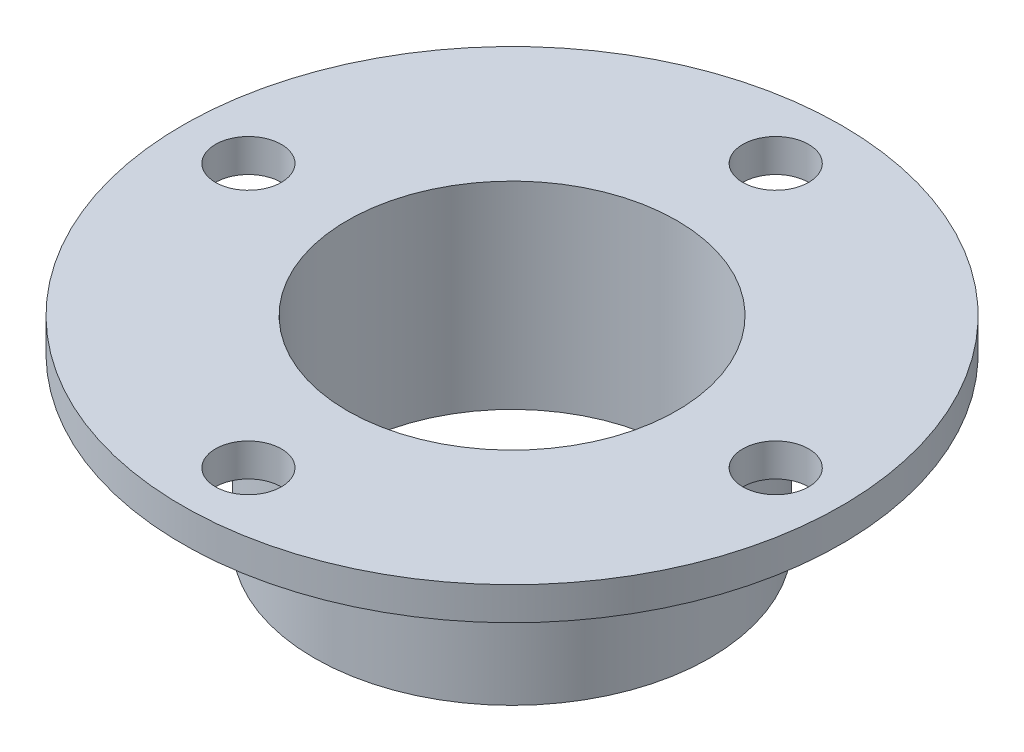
ISO-10303-21;
HEADER;
FILE_DESCRIPTION(('STEP AP214'),'2;1');
FILE_NAME('part.step','',(''),(''),'','','');
FILE_SCHEMA(('AUTOMOTIVE_DESIGN { 1 0 10303 214 1 1 1 1 }'));
ENDSEC;
DATA;
#1=APPLICATION_CONTEXT('core data for automotive mechanical design processes');
#2=APPLICATION_PROTOCOL_DEFINITION('international standard','automotive_design',2000,#1);
#3=PRODUCT_CONTEXT('',#1,'mechanical');
#4=PRODUCT('Part','Part','',(#3));
#5=PRODUCT_RELATED_PRODUCT_CATEGORY('part','',(#4));
#6=PRODUCT_DEFINITION_FORMATION('','',#4);
#7=PRODUCT_DEFINITION_CONTEXT('part definition',#1,'design');
#8=PRODUCT_DEFINITION('design','',#6,#7);
#9=PRODUCT_DEFINITION_SHAPE('','',#8);
#10=(LENGTH_UNIT() NAMED_UNIT(*) SI_UNIT(.MILLI.,.METRE.));
#11=(NAMED_UNIT(*) PLANE_ANGLE_UNIT() SI_UNIT($,.RADIAN.));
#12=(NAMED_UNIT(*) SI_UNIT($,.STERADIAN.) SOLID_ANGLE_UNIT());
#13=UNCERTAINTY_MEASURE_WITH_UNIT(LENGTH_MEASURE(1.E-05),#10,'distance_accuracy_value','');
#14=(GEOMETRIC_REPRESENTATION_CONTEXT(3) GLOBAL_UNCERTAINTY_ASSIGNED_CONTEXT((#13)) GLOBAL_UNIT_ASSIGNED_CONTEXT((#10,
#11,#12)) REPRESENTATION_CONTEXT('',''));
#15=CARTESIAN_POINT('',(0.,0.,0.));
#16=DIRECTION('',(0.,0.,1.));
#17=DIRECTION('',(1.,0.,0.));
#18=AXIS2_PLACEMENT_3D('',#15,#16,#17);
#19=CARTESIAN_POINT('',(38.1,0.,0.));
#20=DIRECTION('',(0.,-1.,0.));
#21=DIRECTION('',(0.,0.,-1.));
#22=AXIS2_PLACEMENT_3D('',#19,#20,#21);
#23=PLANE('',#22);
#24=CARTESIAN_POINT('',(0.,0.,0.));
#25=DIRECTION('',(0.,-1.,0.));
#26=DIRECTION('',(0.,0.,-1.));
#27=AXIS2_PLACEMENT_3D('',#24,#25,#26);
#28=CIRCLE('',#27,31.75);
#29=CARTESIAN_POINT('',(0.,0.,-31.75));
#30=VERTEX_POINT('',#29);
#31=EDGE_CURVE('E49',#30,#30,#28,.T.);
#32=ORIENTED_EDGE('',*,*,#31,.F.);
#33=EDGE_LOOP('',(#32));
#34=FACE_BOUND('',#33,.T.);
#35=CARTESIAN_POINT('',(0.,0.,0.));
#36=DIRECTION('',(0.,-1.,0.));
#37=DIRECTION('',(0.,0.,-1.));
#38=AXIS2_PLACEMENT_3D('',#35,#36,#37);
#39=CIRCLE('',#38,38.1);
#40=CARTESIAN_POINT('',(0.,0.,-38.1));
#41=VERTEX_POINT('',#40);
#42=EDGE_CURVE('E74',#41,#41,#39,.T.);
#43=ORIENTED_EDGE('',*,*,#42,.T.);
#44=EDGE_LOOP('',(#43));
#45=FACE_BOUND('',#44,.T.);
#46=ADVANCED_FACE('F30',(#34,#45),#23,.T.);
#47=CARTESIAN_POINT('',(0.,38.1,0.));
#48=DIRECTION('',(0.,1.,0.));
#49=DIRECTION('',(0.,0.,1.));
#50=AXIS2_PLACEMENT_3D('',#47,#48,#49);
#51=PLANE('',#50);
#52=CARTESIAN_POINT('',(-50.8,38.1,-5.3210206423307E-13));
#53=DIRECTION('',(0.,1.,0.));
#54=DIRECTION('',(1.,0.,0.));
#55=AXIS2_PLACEMENT_3D('',#52,#53,#54);
#56=CIRCLE('',#55,6.35);
#57=CARTESIAN_POINT('',(-50.8,38.1,6.34999999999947));
#58=VERTEX_POINT('',#57);
#59=EDGE_CURVE('E66',#58,#58,#56,.T.);
#60=ORIENTED_EDGE('',*,*,#59,.F.);
#61=EDGE_LOOP('',(#60));
#62=FACE_BOUND('',#61,.T.);
#63=CARTESIAN_POINT('',(0.,38.1,50.8));
#64=DIRECTION('',(0.,1.,0.));
#65=DIRECTION('',(0.,0.,-1.));
#66=AXIS2_PLACEMENT_3D('',#63,#64,#65);
#67=CIRCLE('',#66,6.35);
#68=CARTESIAN_POINT('',(0.,38.1,57.15));
#69=VERTEX_POINT('',#68);
#70=EDGE_CURVE('E56',#69,#69,#67,.T.);
#71=ORIENTED_EDGE('',*,*,#70,.F.);
#72=EDGE_LOOP('',(#71));
#73=FACE_BOUND('',#72,.T.);
#74=CARTESIAN_POINT('',(50.8,38.1,1.77367354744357E-13));
#75=DIRECTION('',(0.,1.,0.));
#76=DIRECTION('',(-1.,0.,0.));
#77=AXIS2_PLACEMENT_3D('',#74,#75,#76);
#78=CIRCLE('',#77,6.35);
#79=CARTESIAN_POINT('',(50.8,38.1,6.35000000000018));
#80=VERTEX_POINT('',#79);
#81=EDGE_CURVE('E53',#80,#80,#78,.T.);
#82=ORIENTED_EDGE('',*,*,#81,.F.);
#83=EDGE_LOOP('',(#82));
#84=FACE_BOUND('',#83,.T.);
#85=CARTESIAN_POINT('',(0.,38.1,-50.8));
#86=DIRECTION('',(0.,1.,0.));
#87=DIRECTION('',(0.,0.,1.));
#88=AXIS2_PLACEMENT_3D('',#85,#86,#87);
#89=CIRCLE('',#88,6.35);
#90=CARTESIAN_POINT('',(0.,38.1,-44.45));
#91=VERTEX_POINT('',#90);
#92=EDGE_CURVE('E50',#91,#91,#89,.T.);
#93=ORIENTED_EDGE('',*,*,#92,.F.);
#94=EDGE_LOOP('',(#93));
#95=FACE_BOUND('',#94,.T.);
#96=CARTESIAN_POINT('',(0.,38.1,0.));
#97=DIRECTION('',(0.,-1.,0.));
#98=DIRECTION('',(0.,0.,-1.));
#99=AXIS2_PLACEMENT_3D('',#96,#97,#98);
#100=CIRCLE('',#99,31.75);
#101=CARTESIAN_POINT('',(0.,38.1,-31.75));
#102=VERTEX_POINT('',#101);
#103=EDGE_CURVE('E71',#102,#102,#100,.T.);
#104=ORIENTED_EDGE('',*,*,#103,.T.);
#105=EDGE_LOOP('',(#104));
#106=FACE_BOUND('',#105,.T.);
#107=CARTESIAN_POINT('',(0.,38.1,0.));
#108=DIRECTION('',(0.,-1.,0.));
#109=DIRECTION('',(0.,0.,-1.));
#110=AXIS2_PLACEMENT_3D('',#107,#108,#109);
#111=CIRCLE('',#110,63.5);
#112=CARTESIAN_POINT('',(0.,38.1,-63.5));
#113=VERTEX_POINT('',#112);
#114=EDGE_CURVE('E10',#113,#113,#111,.T.);
#115=ORIENTED_EDGE('',*,*,#114,.F.);
#116=EDGE_LOOP('',(#115));
#117=FACE_BOUND('',#116,.T.);
#118=ADVANCED_FACE('F95',(#62,#73,#84,#95,#106,#117),#51,.T.);
#119=CARTESIAN_POINT('',(0.,0.,0.));
#120=DIRECTION('',(0.,-1.,0.));
#121=DIRECTION('',(0.,0.,-1.));
#122=AXIS2_PLACEMENT_3D('',#119,#120,#121);
#123=CYLINDRICAL_SURFACE('',#122,63.5);
#124=ORIENTED_EDGE('',*,*,#114,.T.);
#125=EDGE_LOOP('',(#124));
#126=FACE_BOUND('',#125,.T.);
#127=CARTESIAN_POINT('',(0.,31.75,0.));
#128=DIRECTION('',(0.,-1.,0.));
#129=DIRECTION('',(0.,0.,-1.));
#130=AXIS2_PLACEMENT_3D('',#127,#128,#129);
#131=CIRCLE('',#130,63.5);
#132=CARTESIAN_POINT('',(0.,31.75,-63.5));
#133=VERTEX_POINT('',#132);
#134=EDGE_CURVE('E37',#133,#133,#131,.T.);
#135=ORIENTED_EDGE('',*,*,#134,.F.);
#136=EDGE_LOOP('',(#135));
#137=FACE_BOUND('',#136,.T.);
#138=ADVANCED_FACE('F86',(#126,#137),#123,.T.);
#139=CARTESIAN_POINT('',(63.5,31.75,0.));
#140=DIRECTION('',(0.,-1.,0.));
#141=DIRECTION('',(0.,0.,-1.));
#142=AXIS2_PLACEMENT_3D('',#139,#140,#141);
#143=PLANE('',#142);
#144=CARTESIAN_POINT('',(-50.8,31.75,-5.3210206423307E-13));
#145=DIRECTION('',(0.,-1.,0.));
#146=DIRECTION('',(0.,0.,-1.));
#147=AXIS2_PLACEMENT_3D('',#144,#145,#146);
#148=CIRCLE('',#147,6.35);
#149=CARTESIAN_POINT('',(-50.8,31.75,6.34999999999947));
#150=VERTEX_POINT('',#149);
#151=EDGE_CURVE('E33',#150,#150,#148,.T.);
#152=ORIENTED_EDGE('',*,*,#151,.F.);
#153=EDGE_LOOP('',(#152));
#154=FACE_BOUND('',#153,.T.);
#155=CARTESIAN_POINT('',(0.,31.75,50.8));
#156=DIRECTION('',(0.,-1.,0.));
#157=DIRECTION('',(0.,0.,-1.));
#158=AXIS2_PLACEMENT_3D('',#155,#156,#157);
#159=CIRCLE('',#158,6.35);
#160=CARTESIAN_POINT('',(0.,31.75,57.15));
#161=VERTEX_POINT('',#160);
#162=EDGE_CURVE('E54',#161,#161,#159,.T.);
#163=ORIENTED_EDGE('',*,*,#162,.F.);
#164=EDGE_LOOP('',(#163));
#165=FACE_BOUND('',#164,.T.);
#166=CARTESIAN_POINT('',(50.8,31.75,1.77367354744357E-13));
#167=DIRECTION('',(0.,-1.,0.));
#168=DIRECTION('',(0.,0.,-1.));
#169=AXIS2_PLACEMENT_3D('',#166,#167,#168);
#170=CIRCLE('',#169,6.35);
#171=CARTESIAN_POINT('',(50.8,31.75,6.35000000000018));
#172=VERTEX_POINT('',#171);
#173=EDGE_CURVE('E51',#172,#172,#170,.T.);
#174=ORIENTED_EDGE('',*,*,#173,.F.);
#175=EDGE_LOOP('',(#174));
#176=FACE_BOUND('',#175,.T.);
#177=CARTESIAN_POINT('',(0.,31.75,-50.8));
#178=DIRECTION('',(0.,-1.,0.));
#179=DIRECTION('',(0.,0.,-1.));
#180=AXIS2_PLACEMENT_3D('',#177,#178,#179);
#181=CIRCLE('',#180,6.35);
#182=CARTESIAN_POINT('',(0.,31.75,-44.45));
#183=VERTEX_POINT('',#182);
#184=EDGE_CURVE('E46',#183,#183,#181,.T.);
#185=ORIENTED_EDGE('',*,*,#184,.F.);
#186=EDGE_LOOP('',(#185));
#187=FACE_BOUND('',#186,.T.);
#188=ORIENTED_EDGE('',*,*,#134,.T.);
#189=EDGE_LOOP('',(#188));
#190=FACE_BOUND('',#189,.T.);
#191=CARTESIAN_POINT('',(0.,31.75,0.));
#192=DIRECTION('',(0.,-1.,0.));
#193=DIRECTION('',(0.,0.,-1.));
#194=AXIS2_PLACEMENT_3D('',#191,#192,#193);
#195=CIRCLE('',#194,38.1);
#196=CARTESIAN_POINT('',(0.,31.75,-38.1));
#197=VERTEX_POINT('',#196);
#198=EDGE_CURVE('E42',#197,#197,#195,.T.);
#199=ORIENTED_EDGE('',*,*,#198,.F.);
#200=EDGE_LOOP('',(#199));
#201=FACE_BOUND('',#200,.T.);
#202=ADVANCED_FACE('F84',(#154,#165,#176,#187,#190,#201),#143,.T.);
#203=CARTESIAN_POINT('',(0.,0.,0.));
#204=DIRECTION('',(0.,-1.,0.));
#205=DIRECTION('',(0.,0.,-1.));
#206=AXIS2_PLACEMENT_3D('',#203,#204,#205);
#207=CYLINDRICAL_SURFACE('',#206,38.1);
#208=ORIENTED_EDGE('',*,*,#198,.T.);
#209=EDGE_LOOP('',(#208));
#210=FACE_BOUND('',#209,.T.);
#211=ORIENTED_EDGE('',*,*,#42,.F.);
#212=EDGE_LOOP('',(#211));
#213=FACE_BOUND('',#212,.T.);
#214=ADVANCED_FACE('F81',(#210,#213),#207,.T.);
#215=CARTESIAN_POINT('',(0.,38.1,0.));
#216=DIRECTION('',(0.,-1.,0.));
#217=DIRECTION('',(0.,0.,-1.));
#218=AXIS2_PLACEMENT_3D('',#215,#216,#217);
#219=CYLINDRICAL_SURFACE('',#218,31.75);
#220=CARTESIAN_POINT('',(0.,38.1,-31.75));
#221=CARTESIAN_POINT('',(0.,37.703125,-31.75));
#222=CARTESIAN_POINT('',(0.,37.30625,-31.75));
#223=CARTESIAN_POINT('',(0.,36.5125,-31.75));
#224=CARTESIAN_POINT('',(0.,36.115625,-31.75));
#225=CARTESIAN_POINT('',(0.,35.321875,-31.75));
#226=CARTESIAN_POINT('',(0.,34.925,-31.75));
#227=CARTESIAN_POINT('',(0.,34.13125,-31.75));
#228=CARTESIAN_POINT('',(0.,33.734375,-31.75));
#229=CARTESIAN_POINT('',(0.,32.940625,-31.75));
#230=CARTESIAN_POINT('',(0.,32.54375,-31.75));
#231=CARTESIAN_POINT('',(0.,31.75,-31.75));
#232=CARTESIAN_POINT('',(0.,31.353125,-31.75));
#233=CARTESIAN_POINT('',(0.,30.559375,-31.75));
#234=CARTESIAN_POINT('',(0.,30.1625,-31.75));
#235=CARTESIAN_POINT('',(0.,29.36875,-31.75));
#236=CARTESIAN_POINT('',(0.,28.971875,-31.75));
#237=CARTESIAN_POINT('',(0.,28.178125,-31.75));
#238=CARTESIAN_POINT('',(0.,27.78125,-31.75));
#239=CARTESIAN_POINT('',(0.,26.9875,-31.75));
#240=CARTESIAN_POINT('',(0.,26.590625,-31.75));
#241=CARTESIAN_POINT('',(0.,25.796875,-31.75));
#242=CARTESIAN_POINT('',(0.,25.4,-31.75));
#243=CARTESIAN_POINT('',(0.,24.60625,-31.75));
#244=CARTESIAN_POINT('',(0.,24.209375,-31.75));
#245=CARTESIAN_POINT('',(0.,23.415625,-31.75));
#246=CARTESIAN_POINT('',(0.,23.01875,-31.75));
#247=CARTESIAN_POINT('',(0.,22.225,-31.75));
#248=CARTESIAN_POINT('',(0.,21.828125,-31.75));
#249=CARTESIAN_POINT('',(0.,21.034375,-31.75));
#250=CARTESIAN_POINT('',(0.,20.6375,-31.75));
#251=CARTESIAN_POINT('',(0.,19.84375,-31.75));
#252=CARTESIAN_POINT('',(0.,19.446875,-31.75));
#253=CARTESIAN_POINT('',(0.,18.653125,-31.75));
#254=CARTESIAN_POINT('',(0.,18.25625,-31.75));
#255=CARTESIAN_POINT('',(0.,17.4625,-31.75));
#256=CARTESIAN_POINT('',(0.,17.065625,-31.75));
#257=CARTESIAN_POINT('',(0.,16.271875,-31.75));
#258=CARTESIAN_POINT('',(0.,15.875,-31.75));
#259=CARTESIAN_POINT('',(0.,15.08125,-31.75));
#260=CARTESIAN_POINT('',(0.,14.684375,-31.75));
#261=CARTESIAN_POINT('',(0.,13.890625,-31.75));
#262=CARTESIAN_POINT('',(0.,13.49375,-31.75));
#263=CARTESIAN_POINT('',(0.,12.7,-31.75));
#264=CARTESIAN_POINT('',(0.,12.303125,-31.75));
#265=CARTESIAN_POINT('',(0.,11.509375,-31.75));
#266=CARTESIAN_POINT('',(0.,11.1125,-31.75));
#267=CARTESIAN_POINT('',(0.,10.31875,-31.75));
#268=CARTESIAN_POINT('',(0.,9.921875,-31.75));
#269=CARTESIAN_POINT('',(0.,9.128125,-31.75));
#270=CARTESIAN_POINT('',(0.,8.73125,-31.75));
#271=CARTESIAN_POINT('',(0.,7.9375,-31.75));
#272=CARTESIAN_POINT('',(0.,7.540625,-31.75));
#273=CARTESIAN_POINT('',(0.,6.746875,-31.75));
#274=CARTESIAN_POINT('',(0.,6.35,-31.75));
#275=CARTESIAN_POINT('',(0.,5.55625,-31.75));
#276=CARTESIAN_POINT('',(0.,5.159375,-31.75));
#277=CARTESIAN_POINT('',(0.,4.365625,-31.75));
#278=CARTESIAN_POINT('',(0.,3.96875,-31.75));
#279=CARTESIAN_POINT('',(0.,3.175,-31.75));
#280=CARTESIAN_POINT('',(0.,2.778125,-31.75));
#281=CARTESIAN_POINT('',(0.,1.984375,-31.75));
#282=CARTESIAN_POINT('',(0.,1.5875,-31.75));
#283=CARTESIAN_POINT('',(0.,0.79375,-31.75));
#284=CARTESIAN_POINT('',(0.,0.396875,-31.75));
#285=CARTESIAN_POINT('',(0.,0.,-31.75));
#286=B_SPLINE_CURVE_WITH_KNOTS('',3,(#220,#221,#222,#223,#224,#225,#226,#227,#228,#229,#230,
#231,#232,#233,#234,#235,#236,#237,#238,#239,#240,#241,#242,#243,#244,#245,#246,#247,#248,#249,
#250,#251,#252,#253,#254,#255,#256,#257,#258,#259,#260,#261,#262,#263,#264,#265,#266,#267,#268,
#269,#270,#271,#272,#273,#274,#275,#276,#277,#278,#279,#280,#281,#282,#283,#284,#285),
.UNSPECIFIED.,.F.,.F.,(4,2,2,2,2,2,2,2,2,2,2,2,2,2,2,2,2,2,2,2,2,2,2,2,2,2,2,2,2,2,2,2,4),(0.,
1.19062499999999,2.38124999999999,3.571875,4.7625,5.953125,7.14375,8.334375,9.525,10.715625,
11.90625,13.096875,14.2875,15.478125,16.66875,17.859375,19.05,20.240625,21.43125,22.621875,
23.8125,25.003125,26.19375,27.384375,28.575,29.765625,30.95625,32.146875,33.3375,34.528125,
35.71875,36.909375,38.1),.UNSPECIFIED.);
#287=EDGE_CURVE('BSEAM93',#102,#30,#286,.T.);
#288=ORIENTED_EDGE('',*,*,#103,.F.);
#289=ORIENTED_EDGE('',*,*,#31,.T.);
#290=ORIENTED_EDGE('',*,*,#287,.T.);
#291=ORIENTED_EDGE('',*,*,#287,.F.);
#292=EDGE_LOOP('',(#288,#290,#289,#291));
#293=FACE_BOUND('',#292,.T.);
#294=ADVANCED_FACE('F93',(#293),#219,.F.);
#295=CARTESIAN_POINT('',(0.,0.,-50.8));
#296=DIRECTION('',(0.,1.,0.));
#297=DIRECTION('',(0.,0.,1.));
#298=AXIS2_PLACEMENT_3D('',#295,#296,#297);
#299=CYLINDRICAL_SURFACE('',#298,6.35);
#300=CARTESIAN_POINT('',(0.,31.75,-44.45));
#301=CARTESIAN_POINT('',(0.,31.8161458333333,-44.45));
#302=CARTESIAN_POINT('',(0.,31.8822916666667,-44.45));
#303=CARTESIAN_POINT('',(0.,32.0145833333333,-44.45));
#304=CARTESIAN_POINT('',(0.,32.0807291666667,-44.45));
#305=CARTESIAN_POINT('',(0.,32.2130208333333,-44.45));
#306=CARTESIAN_POINT('',(0.,32.2791666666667,-44.45));
#307=CARTESIAN_POINT('',(0.,32.4114583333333,-44.45));
#308=CARTESIAN_POINT('',(0.,32.4776041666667,-44.45));
#309=CARTESIAN_POINT('',(0.,32.6098958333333,-44.45));
#310=CARTESIAN_POINT('',(0.,32.6760416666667,-44.45));
#311=CARTESIAN_POINT('',(0.,32.8083333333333,-44.45));
#312=CARTESIAN_POINT('',(0.,32.8744791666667,-44.45));
#313=CARTESIAN_POINT('',(0.,33.0067708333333,-44.45));
#314=CARTESIAN_POINT('',(0.,33.0729166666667,-44.45));
#315=CARTESIAN_POINT('',(0.,33.2052083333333,-44.45));
#316=CARTESIAN_POINT('',(0.,33.2713541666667,-44.45));
#317=CARTESIAN_POINT('',(0.,33.4036458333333,-44.45));
#318=CARTESIAN_POINT('',(0.,33.4697916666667,-44.45));
#319=CARTESIAN_POINT('',(0.,33.6020833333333,-44.45));
#320=CARTESIAN_POINT('',(0.,33.6682291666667,-44.45));
#321=CARTESIAN_POINT('',(0.,33.8005208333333,-44.45));
#322=CARTESIAN_POINT('',(0.,33.8666666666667,-44.45));
#323=CARTESIAN_POINT('',(0.,33.9989583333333,-44.45));
#324=CARTESIAN_POINT('',(0.,34.0651041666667,-44.45));
#325=CARTESIAN_POINT('',(0.,34.1973958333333,-44.45));
#326=CARTESIAN_POINT('',(0.,34.2635416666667,-44.45));
#327=CARTESIAN_POINT('',(0.,34.3958333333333,-44.45));
#328=CARTESIAN_POINT('',(0.,34.4619791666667,-44.45));
#329=CARTESIAN_POINT('',(0.,34.5942708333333,-44.45));
#330=CARTESIAN_POINT('',(0.,34.6604166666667,-44.45));
#331=CARTESIAN_POINT('',(0.,34.7927083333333,-44.45));
#332=CARTESIAN_POINT('',(0.,34.8588541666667,-44.45));
#333=CARTESIAN_POINT('',(0.,34.9911458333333,-44.45));
#334=CARTESIAN_POINT('',(0.,35.0572916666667,-44.45));
#335=CARTESIAN_POINT('',(0.,35.1895833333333,-44.45));
#336=CARTESIAN_POINT('',(0.,35.2557291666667,-44.45));
#337=CARTESIAN_POINT('',(0.,35.3880208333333,-44.45));
#338=CARTESIAN_POINT('',(0.,35.4541666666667,-44.45));
#339=CARTESIAN_POINT('',(0.,35.5864583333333,-44.45));
#340=CARTESIAN_POINT('',(0.,35.6526041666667,-44.45));
#341=CARTESIAN_POINT('',(0.,35.7848958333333,-44.45));
#342=CARTESIAN_POINT('',(0.,35.8510416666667,-44.45));
#343=CARTESIAN_POINT('',(0.,35.9833333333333,-44.45));
#344=CARTESIAN_POINT('',(0.,36.0494791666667,-44.45));
#345=CARTESIAN_POINT('',(0.,36.1817708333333,-44.45));
#346=CARTESIAN_POINT('',(0.,36.2479166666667,-44.45));
#347=CARTESIAN_POINT('',(0.,36.3802083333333,-44.45));
#348=CARTESIAN_POINT('',(0.,36.4463541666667,-44.45));
#349=CARTESIAN_POINT('',(0.,36.5786458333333,-44.45));
#350=CARTESIAN_POINT('',(0.,36.6447916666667,-44.45));
#351=CARTESIAN_POINT('',(0.,36.7770833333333,-44.45));
#352=CARTESIAN_POINT('',(0.,36.8432291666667,-44.45));
#353=CARTESIAN_POINT('',(0.,36.9755208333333,-44.45));
#354=CARTESIAN_POINT('',(0.,37.0416666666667,-44.45));
#355=CARTESIAN_POINT('',(0.,37.1739583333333,-44.45));
#356=CARTESIAN_POINT('',(0.,37.2401041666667,-44.45));
#357=CARTESIAN_POINT('',(0.,37.3723958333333,-44.45));
#358=CARTESIAN_POINT('',(0.,37.4385416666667,-44.45));
#359=CARTESIAN_POINT('',(0.,37.5708333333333,-44.45));
#360=CARTESIAN_POINT('',(0.,37.6369791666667,-44.45));
#361=CARTESIAN_POINT('',(0.,37.7692708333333,-44.45));
#362=CARTESIAN_POINT('',(0.,37.8354166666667,-44.45));
#363=CARTESIAN_POINT('',(0.,37.9677083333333,-44.45));
#364=CARTESIAN_POINT('',(0.,38.0338541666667,-44.45));
#365=CARTESIAN_POINT('',(0.,38.1,-44.45));
#366=B_SPLINE_CURVE_WITH_KNOTS('',3,(#300,#301,#302,#303,#304,#305,#306,#307,#308,#309,#310,
#311,#312,#313,#314,#315,#316,#317,#318,#319,#320,#321,#322,#323,#324,#325,#326,#327,#328,#329,
#330,#331,#332,#333,#334,#335,#336,#337,#338,#339,#340,#341,#342,#343,#344,#345,#346,#347,#348,
#349,#350,#351,#352,#353,#354,#355,#356,#357,#358,#359,#360,#361,#362,#363,#364,#365),
.UNSPECIFIED.,.F.,.F.,(4,2,2,2,2,2,2,2,2,2,2,2,2,2,2,2,2,2,2,2,2,2,2,2,2,2,2,2,2,2,2,2,4),(0.,
0.198437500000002,0.396874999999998,0.5953125,0.793749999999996,0.992187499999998,1.190625,
1.3890625,1.5875,1.7859375,1.984375,2.1828125,2.38125,2.5796875,2.778125,2.97656249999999,3.175,
3.3734375,3.571875,3.7703125,3.96874999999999,4.1671875,4.365625,4.56406249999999,4.7625,
4.9609375,5.15937499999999,5.3578125,5.55625,5.75468749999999,5.953125,6.15156249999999,
6.34999999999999),.UNSPECIFIED.);
#367=EDGE_CURVE('BSEAM110',#183,#91,#366,.T.);
#368=ORIENTED_EDGE('',*,*,#184,.T.);
#369=ORIENTED_EDGE('',*,*,#92,.T.);
#370=ORIENTED_EDGE('',*,*,#367,.T.);
#371=ORIENTED_EDGE('',*,*,#367,.F.);
#372=EDGE_LOOP('',(#368,#370,#369,#371));
#373=FACE_BOUND('',#372,.T.);
#374=ADVANCED_FACE('F110',(#373),#299,.F.);
#375=CARTESIAN_POINT('',(50.8,0.,1.77367354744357E-13));
#376=DIRECTION('',(0.,1.,0.));
#377=DIRECTION('',(0.,0.,1.));
#378=AXIS2_PLACEMENT_3D('',#375,#376,#377);
#379=CYLINDRICAL_SURFACE('',#378,6.35);
#380=CARTESIAN_POINT('',(50.8,31.75,6.35000000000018));
#381=CARTESIAN_POINT('',(50.8,31.8161458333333,6.35000000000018));
#382=CARTESIAN_POINT('',(50.8,31.8822916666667,6.35000000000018));
#383=CARTESIAN_POINT('',(50.8,32.0145833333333,6.35000000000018));
#384=CARTESIAN_POINT('',(50.8,32.0807291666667,6.35000000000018));
#385=CARTESIAN_POINT('',(50.8,32.2130208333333,6.35000000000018));
#386=CARTESIAN_POINT('',(50.8,32.2791666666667,6.35000000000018));
#387=CARTESIAN_POINT('',(50.8,32.4114583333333,6.35000000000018));
#388=CARTESIAN_POINT('',(50.8,32.4776041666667,6.35000000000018));
#389=CARTESIAN_POINT('',(50.8,32.6098958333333,6.35000000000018));
#390=CARTESIAN_POINT('',(50.8,32.6760416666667,6.35000000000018));
#391=CARTESIAN_POINT('',(50.8,32.8083333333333,6.35000000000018));
#392=CARTESIAN_POINT('',(50.8,32.8744791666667,6.35000000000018));
#393=CARTESIAN_POINT('',(50.8,33.0067708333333,6.35000000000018));
#394=CARTESIAN_POINT('',(50.8,33.0729166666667,6.35000000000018));
#395=CARTESIAN_POINT('',(50.8,33.2052083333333,6.35000000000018));
#396=CARTESIAN_POINT('',(50.8,33.2713541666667,6.35000000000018));
#397=CARTESIAN_POINT('',(50.8,33.4036458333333,6.35000000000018));
#398=CARTESIAN_POINT('',(50.8,33.4697916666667,6.35000000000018));
#399=CARTESIAN_POINT('',(50.8,33.6020833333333,6.35000000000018));
#400=CARTESIAN_POINT('',(50.8,33.6682291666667,6.35000000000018));
#401=CARTESIAN_POINT('',(50.8,33.8005208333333,6.35000000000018));
#402=CARTESIAN_POINT('',(50.8,33.8666666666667,6.35000000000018));
#403=CARTESIAN_POINT('',(50.8,33.9989583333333,6.35000000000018));
#404=CARTESIAN_POINT('',(50.8,34.0651041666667,6.35000000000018));
#405=CARTESIAN_POINT('',(50.8,34.1973958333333,6.35000000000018));
#406=CARTESIAN_POINT('',(50.8,34.2635416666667,6.35000000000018));
#407=CARTESIAN_POINT('',(50.8,34.3958333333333,6.35000000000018));
#408=CARTESIAN_POINT('',(50.8,34.4619791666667,6.35000000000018));
#409=CARTESIAN_POINT('',(50.8,34.5942708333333,6.35000000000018));
#410=CARTESIAN_POINT('',(50.8,34.6604166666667,6.35000000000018));
#411=CARTESIAN_POINT('',(50.8,34.7927083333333,6.35000000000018));
#412=CARTESIAN_POINT('',(50.8,34.8588541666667,6.35000000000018));
#413=CARTESIAN_POINT('',(50.8,34.9911458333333,6.35000000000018));
#414=CARTESIAN_POINT('',(50.8,35.0572916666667,6.35000000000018));
#415=CARTESIAN_POINT('',(50.8,35.1895833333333,6.35000000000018));
#416=CARTESIAN_POINT('',(50.8,35.2557291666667,6.35000000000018));
#417=CARTESIAN_POINT('',(50.8,35.3880208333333,6.35000000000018));
#418=CARTESIAN_POINT('',(50.8,35.4541666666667,6.35000000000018));
#419=CARTESIAN_POINT('',(50.8,35.5864583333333,6.35000000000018));
#420=CARTESIAN_POINT('',(50.8,35.6526041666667,6.35000000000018));
#421=CARTESIAN_POINT('',(50.8,35.7848958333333,6.35000000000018));
#422=CARTESIAN_POINT('',(50.8,35.8510416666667,6.35000000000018));
#423=CARTESIAN_POINT('',(50.8,35.9833333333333,6.35000000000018));
#424=CARTESIAN_POINT('',(50.8,36.0494791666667,6.35000000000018));
#425=CARTESIAN_POINT('',(50.8,36.1817708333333,6.35000000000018));
#426=CARTESIAN_POINT('',(50.8,36.2479166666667,6.35000000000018));
#427=CARTESIAN_POINT('',(50.8,36.3802083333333,6.35000000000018));
#428=CARTESIAN_POINT('',(50.8,36.4463541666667,6.35000000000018));
#429=CARTESIAN_POINT('',(50.8,36.5786458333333,6.35000000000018));
#430=CARTESIAN_POINT('',(50.8,36.6447916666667,6.35000000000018));
#431=CARTESIAN_POINT('',(50.8,36.7770833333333,6.35000000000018));
#432=CARTESIAN_POINT('',(50.8,36.8432291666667,6.35000000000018));
#433=CARTESIAN_POINT('',(50.8,36.9755208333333,6.35000000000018));
#434=CARTESIAN_POINT('',(50.8,37.0416666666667,6.35000000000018));
#435=CARTESIAN_POINT('',(50.8,37.1739583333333,6.35000000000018));
#436=CARTESIAN_POINT('',(50.8,37.2401041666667,6.35000000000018));
#437=CARTESIAN_POINT('',(50.8,37.3723958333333,6.35000000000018));
#438=CARTESIAN_POINT('',(50.8,37.4385416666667,6.35000000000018));
#439=CARTESIAN_POINT('',(50.8,37.5708333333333,6.35000000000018));
#440=CARTESIAN_POINT('',(50.8,37.6369791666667,6.35000000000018));
#441=CARTESIAN_POINT('',(50.8,37.7692708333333,6.35000000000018));
#442=CARTESIAN_POINT('',(50.8,37.8354166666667,6.35000000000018));
#443=CARTESIAN_POINT('',(50.8,37.9677083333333,6.35000000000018));
#444=CARTESIAN_POINT('',(50.8,38.0338541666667,6.35000000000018));
#445=CARTESIAN_POINT('',(50.8,38.1,6.35000000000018));
#446=B_SPLINE_CURVE_WITH_KNOTS('',3,(#380,#381,#382,#383,#384,#385,#386,#387,#388,#389,#390,
#391,#392,#393,#394,#395,#396,#397,#398,#399,#400,#401,#402,#403,#404,#405,#406,#407,#408,#409,
#410,#411,#412,#413,#414,#415,#416,#417,#418,#419,#420,#421,#422,#423,#424,#425,#426,#427,#428,
#429,#430,#431,#432,#433,#434,#435,#436,#437,#438,#439,#440,#441,#442,#443,#444,#445),
.UNSPECIFIED.,.F.,.F.,(4,2,2,2,2,2,2,2,2,2,2,2,2,2,2,2,2,2,2,2,2,2,2,2,2,2,2,2,2,2,2,2,4),(0.,
0.198437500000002,0.396874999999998,0.5953125,0.793749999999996,0.992187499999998,1.190625,
1.3890625,1.5875,1.7859375,1.984375,2.1828125,2.38125,2.5796875,2.778125,2.97656249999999,3.175,
3.3734375,3.571875,3.7703125,3.96874999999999,4.1671875,4.365625,4.56406249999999,4.7625,
4.9609375,5.15937499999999,5.3578125,5.55625,5.75468749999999,5.953125,6.15156249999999,
6.34999999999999),.UNSPECIFIED.);
#447=EDGE_CURVE('BSEAM116',#172,#80,#446,.T.);
#448=ORIENTED_EDGE('',*,*,#173,.T.);
#449=ORIENTED_EDGE('',*,*,#81,.T.);
#450=ORIENTED_EDGE('',*,*,#447,.T.);
#451=ORIENTED_EDGE('',*,*,#447,.F.);
#452=EDGE_LOOP('',(#448,#450,#449,#451));
#453=FACE_BOUND('',#452,.T.);
#454=ADVANCED_FACE('F116',(#453),#379,.F.);
#455=CARTESIAN_POINT('',(0.,0.,50.8));
#456=DIRECTION('',(0.,1.,0.));
#457=DIRECTION('',(0.,0.,1.));
#458=AXIS2_PLACEMENT_3D('',#455,#456,#457);
#459=CYLINDRICAL_SURFACE('',#458,6.35);
#460=CARTESIAN_POINT('',(0.,31.75,57.15));
#461=CARTESIAN_POINT('',(0.,31.8161458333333,57.15));
#462=CARTESIAN_POINT('',(0.,31.8822916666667,57.15));
#463=CARTESIAN_POINT('',(0.,32.0145833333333,57.15));
#464=CARTESIAN_POINT('',(0.,32.0807291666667,57.15));
#465=CARTESIAN_POINT('',(0.,32.2130208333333,57.15));
#466=CARTESIAN_POINT('',(0.,32.2791666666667,57.15));
#467=CARTESIAN_POINT('',(0.,32.4114583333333,57.15));
#468=CARTESIAN_POINT('',(0.,32.4776041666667,57.15));
#469=CARTESIAN_POINT('',(0.,32.6098958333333,57.15));
#470=CARTESIAN_POINT('',(0.,32.6760416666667,57.15));
#471=CARTESIAN_POINT('',(0.,32.8083333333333,57.15));
#472=CARTESIAN_POINT('',(0.,32.8744791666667,57.15));
#473=CARTESIAN_POINT('',(0.,33.0067708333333,57.15));
#474=CARTESIAN_POINT('',(0.,33.0729166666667,57.15));
#475=CARTESIAN_POINT('',(0.,33.2052083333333,57.15));
#476=CARTESIAN_POINT('',(0.,33.2713541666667,57.15));
#477=CARTESIAN_POINT('',(0.,33.4036458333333,57.15));
#478=CARTESIAN_POINT('',(0.,33.4697916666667,57.15));
#479=CARTESIAN_POINT('',(0.,33.6020833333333,57.15));
#480=CARTESIAN_POINT('',(0.,33.6682291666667,57.15));
#481=CARTESIAN_POINT('',(0.,33.8005208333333,57.15));
#482=CARTESIAN_POINT('',(0.,33.8666666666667,57.15));
#483=CARTESIAN_POINT('',(0.,33.9989583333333,57.15));
#484=CARTESIAN_POINT('',(0.,34.0651041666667,57.15));
#485=CARTESIAN_POINT('',(0.,34.1973958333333,57.15));
#486=CARTESIAN_POINT('',(0.,34.2635416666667,57.15));
#487=CARTESIAN_POINT('',(0.,34.3958333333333,57.15));
#488=CARTESIAN_POINT('',(0.,34.4619791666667,57.15));
#489=CARTESIAN_POINT('',(0.,34.5942708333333,57.15));
#490=CARTESIAN_POINT('',(0.,34.6604166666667,57.15));
#491=CARTESIAN_POINT('',(0.,34.7927083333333,57.15));
#492=CARTESIAN_POINT('',(0.,34.8588541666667,57.15));
#493=CARTESIAN_POINT('',(0.,34.9911458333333,57.15));
#494=CARTESIAN_POINT('',(0.,35.0572916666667,57.15));
#495=CARTESIAN_POINT('',(0.,35.1895833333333,57.15));
#496=CARTESIAN_POINT('',(0.,35.2557291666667,57.15));
#497=CARTESIAN_POINT('',(0.,35.3880208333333,57.15));
#498=CARTESIAN_POINT('',(0.,35.4541666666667,57.15));
#499=CARTESIAN_POINT('',(0.,35.5864583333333,57.15));
#500=CARTESIAN_POINT('',(0.,35.6526041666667,57.15));
#501=CARTESIAN_POINT('',(0.,35.7848958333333,57.15));
#502=CARTESIAN_POINT('',(0.,35.8510416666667,57.15));
#503=CARTESIAN_POINT('',(0.,35.9833333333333,57.15));
#504=CARTESIAN_POINT('',(0.,36.0494791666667,57.15));
#505=CARTESIAN_POINT('',(0.,36.1817708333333,57.15));
#506=CARTESIAN_POINT('',(0.,36.2479166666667,57.15));
#507=CARTESIAN_POINT('',(0.,36.3802083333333,57.15));
#508=CARTESIAN_POINT('',(0.,36.4463541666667,57.15));
#509=CARTESIAN_POINT('',(0.,36.5786458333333,57.15));
#510=CARTESIAN_POINT('',(0.,36.6447916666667,57.15));
#511=CARTESIAN_POINT('',(0.,36.7770833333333,57.15));
#512=CARTESIAN_POINT('',(0.,36.8432291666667,57.15));
#513=CARTESIAN_POINT('',(0.,36.9755208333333,57.15));
#514=CARTESIAN_POINT('',(0.,37.0416666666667,57.15));
#515=CARTESIAN_POINT('',(0.,37.1739583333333,57.15));
#516=CARTESIAN_POINT('',(0.,37.2401041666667,57.15));
#517=CARTESIAN_POINT('',(0.,37.3723958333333,57.15));
#518=CARTESIAN_POINT('',(0.,37.4385416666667,57.15));
#519=CARTESIAN_POINT('',(0.,37.5708333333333,57.15));
#520=CARTESIAN_POINT('',(0.,37.6369791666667,57.15));
#521=CARTESIAN_POINT('',(0.,37.7692708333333,57.15));
#522=CARTESIAN_POINT('',(0.,37.8354166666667,57.15));
#523=CARTESIAN_POINT('',(0.,37.9677083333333,57.15));
#524=CARTESIAN_POINT('',(0.,38.0338541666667,57.15));
#525=CARTESIAN_POINT('',(0.,38.1,57.15));
#526=B_SPLINE_CURVE_WITH_KNOTS('',3,(#460,#461,#462,#463,#464,#465,#466,#467,#468,#469,#470,
#471,#472,#473,#474,#475,#476,#477,#478,#479,#480,#481,#482,#483,#484,#485,#486,#487,#488,#489,
#490,#491,#492,#493,#494,#495,#496,#497,#498,#499,#500,#501,#502,#503,#504,#505,#506,#507,#508,
#509,#510,#511,#512,#513,#514,#515,#516,#517,#518,#519,#520,#521,#522,#523,#524,#525),
.UNSPECIFIED.,.F.,.F.,(4,2,2,2,2,2,2,2,2,2,2,2,2,2,2,2,2,2,2,2,2,2,2,2,2,2,2,2,2,2,2,2,4),(0.,
0.198437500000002,0.396874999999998,0.5953125,0.793749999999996,0.992187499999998,1.190625,
1.3890625,1.5875,1.7859375,1.984375,2.1828125,2.38125,2.5796875,2.778125,2.97656249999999,3.175,
3.3734375,3.571875,3.7703125,3.96874999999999,4.1671875,4.365625,4.56406249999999,4.7625,
4.9609375,5.15937499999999,5.3578125,5.55625,5.75468749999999,5.953125,6.15156249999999,
6.34999999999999),.UNSPECIFIED.);
#527=EDGE_CURVE('BSEAM123',#161,#69,#526,.T.);
#528=ORIENTED_EDGE('',*,*,#162,.T.);
#529=ORIENTED_EDGE('',*,*,#70,.T.);
#530=ORIENTED_EDGE('',*,*,#527,.T.);
#531=ORIENTED_EDGE('',*,*,#527,.F.);
#532=EDGE_LOOP('',(#528,#530,#529,#531));
#533=FACE_BOUND('',#532,.T.);
#534=ADVANCED_FACE('F123',(#533),#459,.F.);
#535=CARTESIAN_POINT('',(-50.8,0.,-5.3210206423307E-13));
#536=DIRECTION('',(0.,1.,0.));
#537=DIRECTION('',(0.,0.,1.));
#538=AXIS2_PLACEMENT_3D('',#535,#536,#537);
#539=CYLINDRICAL_SURFACE('',#538,6.35);
#540=CARTESIAN_POINT('',(-50.8,31.75,6.34999999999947));
#541=CARTESIAN_POINT('',(-50.8,31.8161458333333,6.34999999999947));
#542=CARTESIAN_POINT('',(-50.8,31.8822916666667,6.34999999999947));
#543=CARTESIAN_POINT('',(-50.8,32.0145833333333,6.34999999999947));
#544=CARTESIAN_POINT('',(-50.8,32.0807291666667,6.34999999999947));
#545=CARTESIAN_POINT('',(-50.8,32.2130208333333,6.34999999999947));
#546=CARTESIAN_POINT('',(-50.8,32.2791666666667,6.34999999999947));
#547=CARTESIAN_POINT('',(-50.8,32.4114583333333,6.34999999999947));
#548=CARTESIAN_POINT('',(-50.8,32.4776041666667,6.34999999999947));
#549=CARTESIAN_POINT('',(-50.8,32.6098958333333,6.34999999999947));
#550=CARTESIAN_POINT('',(-50.8,32.6760416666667,6.34999999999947));
#551=CARTESIAN_POINT('',(-50.8,32.8083333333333,6.34999999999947));
#552=CARTESIAN_POINT('',(-50.8,32.8744791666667,6.34999999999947));
#553=CARTESIAN_POINT('',(-50.8,33.0067708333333,6.34999999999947));
#554=CARTESIAN_POINT('',(-50.8,33.0729166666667,6.34999999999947));
#555=CARTESIAN_POINT('',(-50.8,33.2052083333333,6.34999999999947));
#556=CARTESIAN_POINT('',(-50.8,33.2713541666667,6.34999999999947));
#557=CARTESIAN_POINT('',(-50.8,33.4036458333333,6.34999999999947));
#558=CARTESIAN_POINT('',(-50.8,33.4697916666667,6.34999999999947));
#559=CARTESIAN_POINT('',(-50.8,33.6020833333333,6.34999999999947));
#560=CARTESIAN_POINT('',(-50.8,33.6682291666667,6.34999999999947));
#561=CARTESIAN_POINT('',(-50.8,33.8005208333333,6.34999999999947));
#562=CARTESIAN_POINT('',(-50.8,33.8666666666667,6.34999999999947));
#563=CARTESIAN_POINT('',(-50.8,33.9989583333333,6.34999999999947));
#564=CARTESIAN_POINT('',(-50.8,34.0651041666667,6.34999999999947));
#565=CARTESIAN_POINT('',(-50.8,34.1973958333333,6.34999999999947));
#566=CARTESIAN_POINT('',(-50.8,34.2635416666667,6.34999999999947));
#567=CARTESIAN_POINT('',(-50.8,34.3958333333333,6.34999999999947));
#568=CARTESIAN_POINT('',(-50.8,34.4619791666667,6.34999999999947));
#569=CARTESIAN_POINT('',(-50.8,34.5942708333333,6.34999999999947));
#570=CARTESIAN_POINT('',(-50.8,34.6604166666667,6.34999999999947));
#571=CARTESIAN_POINT('',(-50.8,34.7927083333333,6.34999999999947));
#572=CARTESIAN_POINT('',(-50.8,34.8588541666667,6.34999999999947));
#573=CARTESIAN_POINT('',(-50.8,34.9911458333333,6.34999999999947));
#574=CARTESIAN_POINT('',(-50.8,35.0572916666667,6.34999999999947));
#575=CARTESIAN_POINT('',(-50.8,35.1895833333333,6.34999999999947));
#576=CARTESIAN_POINT('',(-50.8,35.2557291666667,6.34999999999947));
#577=CARTESIAN_POINT('',(-50.8,35.3880208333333,6.34999999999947));
#578=CARTESIAN_POINT('',(-50.8,35.4541666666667,6.34999999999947));
#579=CARTESIAN_POINT('',(-50.8,35.5864583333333,6.34999999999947));
#580=CARTESIAN_POINT('',(-50.8,35.6526041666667,6.34999999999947));
#581=CARTESIAN_POINT('',(-50.8,35.7848958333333,6.34999999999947));
#582=CARTESIAN_POINT('',(-50.8,35.8510416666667,6.34999999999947));
#583=CARTESIAN_POINT('',(-50.8,35.9833333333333,6.34999999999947));
#584=CARTESIAN_POINT('',(-50.8,36.0494791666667,6.34999999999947));
#585=CARTESIAN_POINT('',(-50.8,36.1817708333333,6.34999999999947));
#586=CARTESIAN_POINT('',(-50.8,36.2479166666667,6.34999999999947));
#587=CARTESIAN_POINT('',(-50.8,36.3802083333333,6.34999999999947));
#588=CARTESIAN_POINT('',(-50.8,36.4463541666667,6.34999999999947));
#589=CARTESIAN_POINT('',(-50.8,36.5786458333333,6.34999999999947));
#590=CARTESIAN_POINT('',(-50.8,36.6447916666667,6.34999999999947));
#591=CARTESIAN_POINT('',(-50.8,36.7770833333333,6.34999999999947));
#592=CARTESIAN_POINT('',(-50.8,36.8432291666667,6.34999999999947));
#593=CARTESIAN_POINT('',(-50.8,36.9755208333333,6.34999999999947));
#594=CARTESIAN_POINT('',(-50.8,37.0416666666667,6.34999999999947));
#595=CARTESIAN_POINT('',(-50.8,37.1739583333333,6.34999999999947));
#596=CARTESIAN_POINT('',(-50.8,37.2401041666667,6.34999999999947));
#597=CARTESIAN_POINT('',(-50.8,37.3723958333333,6.34999999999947));
#598=CARTESIAN_POINT('',(-50.8,37.4385416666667,6.34999999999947));
#599=CARTESIAN_POINT('',(-50.8,37.5708333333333,6.34999999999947));
#600=CARTESIAN_POINT('',(-50.8,37.6369791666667,6.34999999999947));
#601=CARTESIAN_POINT('',(-50.8,37.7692708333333,6.34999999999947));
#602=CARTESIAN_POINT('',(-50.8,37.8354166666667,6.34999999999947));
#603=CARTESIAN_POINT('',(-50.8,37.9677083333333,6.34999999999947));
#604=CARTESIAN_POINT('',(-50.8,38.0338541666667,6.34999999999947));
#605=CARTESIAN_POINT('',(-50.8,38.1,6.34999999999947));
#606=B_SPLINE_CURVE_WITH_KNOTS('',3,(#540,#541,#542,#543,#544,#545,#546,#547,#548,#549,#550,
#551,#552,#553,#554,#555,#556,#557,#558,#559,#560,#561,#562,#563,#564,#565,#566,#567,#568,#569,
#570,#571,#572,#573,#574,#575,#576,#577,#578,#579,#580,#581,#582,#583,#584,#585,#586,#587,#588,
#589,#590,#591,#592,#593,#594,#595,#596,#597,#598,#599,#600,#601,#602,#603,#604,#605),
.UNSPECIFIED.,.F.,.F.,(4,2,2,2,2,2,2,2,2,2,2,2,2,2,2,2,2,2,2,2,2,2,2,2,2,2,2,2,2,2,2,2,4),(0.,
0.198437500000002,0.396874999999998,0.5953125,0.793749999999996,0.992187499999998,1.190625,
1.3890625,1.5875,1.7859375,1.984375,2.1828125,2.38125,2.5796875,2.778125,2.97656249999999,3.175,
3.3734375,3.571875,3.7703125,3.96874999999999,4.1671875,4.365625,4.56406249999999,4.7625,
4.9609375,5.15937499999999,5.3578125,5.55625,5.75468749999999,5.953125,6.15156249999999,
6.34999999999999),.UNSPECIFIED.);
#607=EDGE_CURVE('BSEAM127',#150,#58,#606,.T.);
#608=ORIENTED_EDGE('',*,*,#151,.T.);
#609=ORIENTED_EDGE('',*,*,#59,.T.);
#610=ORIENTED_EDGE('',*,*,#607,.T.);
#611=ORIENTED_EDGE('',*,*,#607,.F.);
#612=EDGE_LOOP('',(#608,#610,#609,#611));
#613=FACE_BOUND('',#612,.T.);
#614=ADVANCED_FACE('F127',(#613),#539,.F.);
#615=CLOSED_SHELL('',(#46,#118,#138,#202,#214,#294,#374,#454,#534,#614));
#616=MANIFOLD_SOLID_BREP('B2',#615);
#617=ADVANCED_BREP_SHAPE_REPRESENTATION('',(#18,#616),#14);
#618=SHAPE_DEFINITION_REPRESENTATION(#9,#617);
ENDSEC;
END-ISO-10303-21;
